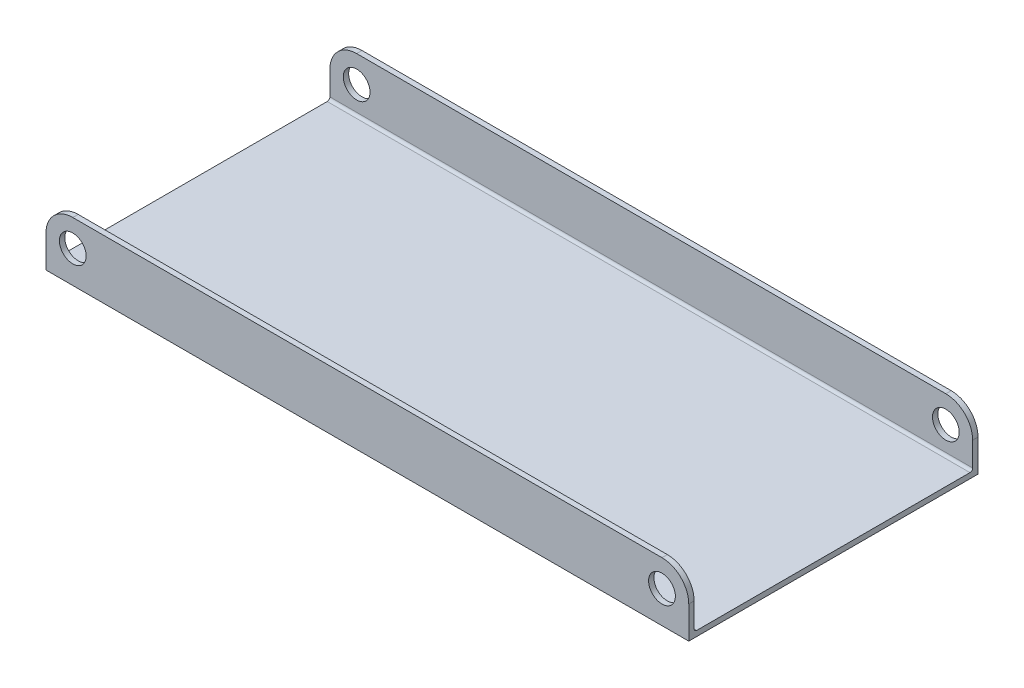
ISO-10303-21;
HEADER;
FILE_DESCRIPTION(('STEP AP214'),'2;1');
FILE_NAME('part.step','',(''),(''),'','','');
FILE_SCHEMA(('AUTOMOTIVE_DESIGN { 1 0 10303 214 1 1 1 1 }'));
ENDSEC;
DATA;
#1=APPLICATION_CONTEXT('core data for automotive mechanical design processes');
#2=APPLICATION_PROTOCOL_DEFINITION('international standard','automotive_design',2000,#1);
#3=PRODUCT_CONTEXT('',#1,'mechanical');
#4=PRODUCT('Part','Part','',(#3));
#5=PRODUCT_RELATED_PRODUCT_CATEGORY('part','',(#4));
#6=PRODUCT_DEFINITION_FORMATION('','',#4);
#7=PRODUCT_DEFINITION_CONTEXT('part definition',#1,'design');
#8=PRODUCT_DEFINITION('design','',#6,#7);
#9=PRODUCT_DEFINITION_SHAPE('','',#8);
#10=(LENGTH_UNIT() NAMED_UNIT(*) SI_UNIT(.MILLI.,.METRE.));
#11=(NAMED_UNIT(*) PLANE_ANGLE_UNIT() SI_UNIT($,.RADIAN.));
#12=(NAMED_UNIT(*) SI_UNIT($,.STERADIAN.) SOLID_ANGLE_UNIT());
#13=UNCERTAINTY_MEASURE_WITH_UNIT(LENGTH_MEASURE(1.E-05),#10,'distance_accuracy_value','');
#14=(GEOMETRIC_REPRESENTATION_CONTEXT(3) GLOBAL_UNCERTAINTY_ASSIGNED_CONTEXT((#13)) GLOBAL_UNIT_ASSIGNED_CONTEXT((#10,
#11,#12)) REPRESENTATION_CONTEXT('',''));
#15=CARTESIAN_POINT('',(0.,0.,0.));
#16=DIRECTION('',(0.,0.,1.));
#17=DIRECTION('',(1.,0.,0.));
#18=AXIS2_PLACEMENT_3D('',#15,#16,#17);
#19=CARTESIAN_POINT('',(0.,1.905,-1.905));
#20=DIRECTION('',(-1.,0.,0.));
#21=DIRECTION('',(0.,0.,1.));
#22=AXIS2_PLACEMENT_3D('',#19,#20,#21);
#23=CYLINDRICAL_SURFACE('',#22,0.635);
#24=DIRECTION('',(1.,0.,0.));
#25=VECTOR('',#24,1.);
#26=CARTESIAN_POINT('',(0.,1.27,-1.905));
#27=LINE('',#26,#25);
#28=CARTESIAN_POINT('',(0.,1.27,-1.905));
#29=VERTEX_POINT('',#28);
#30=CARTESIAN_POINT('',(152.4,1.27,-1.905));
#31=VERTEX_POINT('',#30);
#32=EDGE_CURVE('E193',#29,#31,#27,.T.);
#33=ORIENTED_EDGE('',*,*,#32,.F.);
#34=CARTESIAN_POINT('',(0.,1.905,-1.905));
#35=DIRECTION('',(-1.,0.,0.));
#36=DIRECTION('',(0.,0.,1.));
#37=AXIS2_PLACEMENT_3D('',#34,#35,#36);
#38=CIRCLE('',#37,0.635);
#39=CARTESIAN_POINT('',(0.,1.905,-1.27));
#40=VERTEX_POINT('',#39);
#41=EDGE_CURVE('E44',#29,#40,#38,.T.);
#42=ORIENTED_EDGE('',*,*,#41,.T.);
#43=DIRECTION('',(1.,0.,0.));
#44=VECTOR('',#43,1.);
#45=CARTESIAN_POINT('',(0.,1.905,-1.27));
#46=LINE('',#45,#44);
#47=CARTESIAN_POINT('',(152.4,1.905,-1.27));
#48=VERTEX_POINT('',#47);
#49=EDGE_CURVE('E196',#48,#40,#46,.F.);
#50=ORIENTED_EDGE('',*,*,#49,.F.);
#51=CARTESIAN_POINT('',(152.4,1.905,-1.905));
#52=DIRECTION('',(-1.,0.,0.));
#53=DIRECTION('',(0.,0.,1.));
#54=AXIS2_PLACEMENT_3D('',#51,#52,#53);
#55=CIRCLE('',#54,0.635);
#56=EDGE_CURVE('E11',#48,#31,#55,.F.);
#57=ORIENTED_EDGE('',*,*,#56,.T.);
#58=EDGE_LOOP('',(#33,#42,#50,#57));
#59=FACE_BOUND('',#58,.T.);
#60=ADVANCED_FACE('F37',(#59),#23,.F.);
#61=CARTESIAN_POINT('',(0.,1.905,-66.675));
#62=DIRECTION('',(1.,0.,0.));
#63=DIRECTION('',(0.,0.,-1.));
#64=AXIS2_PLACEMENT_3D('',#61,#62,#63);
#65=CYLINDRICAL_SURFACE('',#64,0.635);
#66=DIRECTION('',(-1.,0.,0.));
#67=VECTOR('',#66,1.);
#68=CARTESIAN_POINT('',(0.,1.27,-66.675));
#69=LINE('',#68,#67);
#70=CARTESIAN_POINT('',(152.4,1.27,-66.675));
#71=VERTEX_POINT('',#70);
#72=CARTESIAN_POINT('',(0.,1.27,-66.675));
#73=VERTEX_POINT('',#72);
#74=EDGE_CURVE('E172',#71,#73,#69,.T.);
#75=ORIENTED_EDGE('',*,*,#74,.F.);
#76=CARTESIAN_POINT('',(152.4,1.905,-66.675));
#77=DIRECTION('',(-1.,0.,0.));
#78=DIRECTION('',(0.,0.,1.));
#79=AXIS2_PLACEMENT_3D('',#76,#77,#78);
#80=CIRCLE('',#79,0.635);
#81=CARTESIAN_POINT('',(152.4,1.905,-67.31));
#82=VERTEX_POINT('',#81);
#83=EDGE_CURVE('E188',#71,#82,#80,.F.);
#84=ORIENTED_EDGE('',*,*,#83,.T.);
#85=DIRECTION('',(-1.,0.,0.));
#86=VECTOR('',#85,1.);
#87=CARTESIAN_POINT('',(0.,1.905,-67.31));
#88=LINE('',#87,#86);
#89=CARTESIAN_POINT('',(0.,1.905,-67.31));
#90=VERTEX_POINT('',#89);
#91=EDGE_CURVE('E185',#90,#82,#88,.F.);
#92=ORIENTED_EDGE('',*,*,#91,.F.);
#93=CARTESIAN_POINT('',(0.,1.905,-66.675));
#94=DIRECTION('',(-1.,0.,0.));
#95=DIRECTION('',(0.,0.,1.));
#96=AXIS2_PLACEMENT_3D('',#93,#94,#95);
#97=CIRCLE('',#96,0.635);
#98=EDGE_CURVE('E190',#90,#73,#97,.T.);
#99=ORIENTED_EDGE('',*,*,#98,.T.);
#100=EDGE_LOOP('',(#75,#84,#92,#99));
#101=FACE_BOUND('',#100,.T.);
#102=ADVANCED_FACE('F297',(#101),#65,.F.);
#103=CARTESIAN_POINT('',(0.,1.27,0.));
#104=DIRECTION('',(0.,0.,-1.));
#105=DIRECTION('',(-1.,0.,0.));
#106=AXIS2_PLACEMENT_3D('',#103,#104,#105);
#107=PLANE('',#106);
#108=CARTESIAN_POINT('',(146.05,7.62,0.));
#109=DIRECTION('',(0.,0.,1.));
#110=DIRECTION('',(1.,0.,0.));
#111=AXIS2_PLACEMENT_3D('',#108,#109,#110);
#112=CIRCLE('',#111,3.175);
#113=CARTESIAN_POINT('',(149.225,7.62,0.));
#114=VERTEX_POINT('',#113);
#115=EDGE_CURVE('E475',#114,#114,#112,.T.);
#116=ORIENTED_EDGE('',*,*,#115,.F.);
#117=EDGE_LOOP('',(#116));
#118=FACE_BOUND('',#117,.T.);
#119=CARTESIAN_POINT('',(6.35,7.62,0.));
#120=DIRECTION('',(0.,0.,1.));
#121=DIRECTION('',(1.,0.,0.));
#122=AXIS2_PLACEMENT_3D('',#119,#120,#121);
#123=CIRCLE('',#122,3.175);
#124=CARTESIAN_POINT('',(9.525,7.62,0.));
#125=VERTEX_POINT('',#124);
#126=EDGE_CURVE('E481',#125,#125,#123,.T.);
#127=ORIENTED_EDGE('',*,*,#126,.F.);
#128=EDGE_LOOP('',(#127));
#129=FACE_BOUND('',#128,.T.);
#130=CARTESIAN_POINT('',(146.05,7.62,0.));
#131=DIRECTION('',(0.,0.,1.));
#132=DIRECTION('',(1.,0.,0.));
#133=AXIS2_PLACEMENT_3D('',#130,#131,#132);
#134=CIRCLE('',#133,6.35);
#135=CARTESIAN_POINT('',(152.4,7.61999999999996,0.));
#136=VERTEX_POINT('',#135);
#137=CARTESIAN_POINT('',(146.05,13.97,0.));
#138=VERTEX_POINT('',#137);
#139=EDGE_CURVE('E156',#136,#138,#134,.T.);
#140=ORIENTED_EDGE('',*,*,#139,.T.);
#141=DIRECTION('',(1.,0.,0.));
#142=VECTOR('',#141,1.);
#143=CARTESIAN_POINT('',(0.,13.97,0.));
#144=LINE('',#143,#142);
#145=CARTESIAN_POINT('',(6.35000000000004,13.97,0.));
#146=VERTEX_POINT('',#145);
#147=EDGE_CURVE('E216',#146,#138,#144,.T.);
#148=ORIENTED_EDGE('',*,*,#147,.F.);
#149=CARTESIAN_POINT('',(6.35,7.62,0.));
#150=DIRECTION('',(0.,0.,1.));
#151=DIRECTION('',(1.,0.,0.));
#152=AXIS2_PLACEMENT_3D('',#149,#150,#151);
#153=CIRCLE('',#152,6.35);
#154=CARTESIAN_POINT('',(0.,7.61999999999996,0.));
#155=VERTEX_POINT('',#154);
#156=EDGE_CURVE('E269',#155,#146,#153,.F.);
#157=ORIENTED_EDGE('',*,*,#156,.F.);
#158=DIRECTION('',(0.,-1.,0.));
#159=VECTOR('',#158,1.);
#160=CARTESIAN_POINT('',(0.,1.27,0.));
#161=LINE('',#160,#159);
#162=CARTESIAN_POINT('',(0.,0.,0.));
#163=VERTEX_POINT('',#162);
#164=EDGE_CURVE('E165',#155,#163,#161,.T.);
#165=ORIENTED_EDGE('',*,*,#164,.T.);
#166=DIRECTION('',(1.,0.,0.));
#167=VECTOR('',#166,1.);
#168=CARTESIAN_POINT('',(0.,0.,0.));
#169=LINE('',#168,#167);
#170=CARTESIAN_POINT('',(152.4,0.,0.));
#171=VERTEX_POINT('',#170);
#172=EDGE_CURVE('E214',#163,#171,#169,.T.);
#173=ORIENTED_EDGE('',*,*,#172,.T.);
#174=DIRECTION('',(0.,-1.,0.));
#175=VECTOR('',#174,1.);
#176=CARTESIAN_POINT('',(152.4,1.27,0.));
#177=LINE('',#176,#175);
#178=EDGE_CURVE('E162',#136,#171,#177,.T.);
#179=ORIENTED_EDGE('',*,*,#178,.F.);
#180=EDGE_LOOP('',(#140,#148,#157,#165,#173,#179));
#181=FACE_BOUND('',#180,.T.);
#182=ADVANCED_FACE('F268',(#118,#129,#181),#107,.F.);
#183=CARTESIAN_POINT('',(0.,1.27,-68.58));
#184=DIRECTION('',(0.,0.,-1.));
#185=DIRECTION('',(-1.,0.,0.));
#186=AXIS2_PLACEMENT_3D('',#183,#184,#185);
#187=PLANE('',#186);
#188=CARTESIAN_POINT('',(146.05,7.62,-68.58));
#189=DIRECTION('',(0.,0.,1.));
#190=DIRECTION('',(1.,0.,0.));
#191=AXIS2_PLACEMENT_3D('',#188,#189,#190);
#192=CIRCLE('',#191,3.175);
#193=CARTESIAN_POINT('',(149.225,7.62,-68.58));
#194=VERTEX_POINT('',#193);
#195=EDGE_CURVE('E182',#194,#194,#192,.T.);
#196=ORIENTED_EDGE('',*,*,#195,.T.);
#197=EDGE_LOOP('',(#196));
#198=FACE_BOUND('',#197,.T.);
#199=CARTESIAN_POINT('',(6.35,7.62,-68.58));
#200=DIRECTION('',(0.,0.,1.));
#201=DIRECTION('',(1.,0.,0.));
#202=AXIS2_PLACEMENT_3D('',#199,#200,#201);
#203=CIRCLE('',#202,3.175);
#204=CARTESIAN_POINT('',(9.525,7.62,-68.58));
#205=VERTEX_POINT('',#204);
#206=EDGE_CURVE('E177',#205,#205,#203,.T.);
#207=ORIENTED_EDGE('',*,*,#206,.T.);
#208=EDGE_LOOP('',(#207));
#209=FACE_BOUND('',#208,.T.);
#210=DIRECTION('',(1.,0.,0.));
#211=VECTOR('',#210,1.);
#212=CARTESIAN_POINT('',(0.,13.97,-68.58));
#213=LINE('',#212,#211);
#214=CARTESIAN_POINT('',(6.35000000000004,13.97,-68.58));
#215=VERTEX_POINT('',#214);
#216=CARTESIAN_POINT('',(146.05,13.97,-68.58));
#217=VERTEX_POINT('',#216);
#218=EDGE_CURVE('E155',#215,#217,#213,.T.);
#219=ORIENTED_EDGE('',*,*,#218,.T.);
#220=CARTESIAN_POINT('',(146.05,7.62,-68.58));
#221=DIRECTION('',(0.,0.,1.));
#222=DIRECTION('',(1.,0.,0.));
#223=AXIS2_PLACEMENT_3D('',#220,#221,#222);
#224=CIRCLE('',#223,6.35);
#225=CARTESIAN_POINT('',(152.4,7.61999999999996,-68.58));
#226=VERTEX_POINT('',#225);
#227=EDGE_CURVE('E137',#226,#217,#224,.T.);
#228=ORIENTED_EDGE('',*,*,#227,.F.);
#229=DIRECTION('',(0.,-1.,0.));
#230=VECTOR('',#229,1.);
#231=CARTESIAN_POINT('',(152.4,1.27,-68.58));
#232=LINE('',#231,#230);
#233=CARTESIAN_POINT('',(152.4,0.,-68.58));
#234=VERTEX_POINT('',#233);
#235=EDGE_CURVE('E151',#226,#234,#232,.T.);
#236=ORIENTED_EDGE('',*,*,#235,.T.);
#237=DIRECTION('',(1.,0.,0.));
#238=VECTOR('',#237,1.);
#239=CARTESIAN_POINT('',(0.,0.,-68.58));
#240=LINE('',#239,#238);
#241=CARTESIAN_POINT('',(0.,0.,-68.58));
#242=VERTEX_POINT('',#241);
#243=EDGE_CURVE('E222',#242,#234,#240,.T.);
#244=ORIENTED_EDGE('',*,*,#243,.F.);
#245=DIRECTION('',(0.,-1.,0.));
#246=VECTOR('',#245,1.);
#247=CARTESIAN_POINT('',(0.,1.27,-68.58));
#248=LINE('',#247,#246);
#249=CARTESIAN_POINT('',(0.,7.61999999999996,-68.58));
#250=VERTEX_POINT('',#249);
#251=EDGE_CURVE('E163',#250,#242,#248,.T.);
#252=ORIENTED_EDGE('',*,*,#251,.F.);
#253=CARTESIAN_POINT('',(6.35,7.62,-68.58));
#254=DIRECTION('',(0.,0.,1.));
#255=DIRECTION('',(1.,0.,0.));
#256=AXIS2_PLACEMENT_3D('',#253,#254,#255);
#257=CIRCLE('',#256,6.35);
#258=EDGE_CURVE('E231',#250,#215,#257,.F.);
#259=ORIENTED_EDGE('',*,*,#258,.T.);
#260=EDGE_LOOP('',(#219,#228,#236,#244,#252,#259));
#261=FACE_BOUND('',#260,.T.);
#262=ADVANCED_FACE('F149',(#198,#209,#261),#187,.T.);
#263=CARTESIAN_POINT('',(0.,13.97,-1.27));
#264=DIRECTION('',(0.,0.,-1.));
#265=DIRECTION('',(-1.,0.,0.));
#266=AXIS2_PLACEMENT_3D('',#263,#264,#265);
#267=PLANE('',#266);
#268=CARTESIAN_POINT('',(146.05,7.62,-1.26999999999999));
#269=DIRECTION('',(0.,0.,-1.));
#270=DIRECTION('',(-1.,0.,0.));
#271=AXIS2_PLACEMENT_3D('',#268,#269,#270);
#272=CIRCLE('',#271,3.175);
#273=CARTESIAN_POINT('',(142.875,7.62,-1.26999999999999));
#274=VERTEX_POINT('',#273);
#275=EDGE_CURVE('E181',#274,#274,#272,.T.);
#276=ORIENTED_EDGE('',*,*,#275,.F.);
#277=EDGE_LOOP('',(#276));
#278=FACE_BOUND('',#277,.T.);
#279=CARTESIAN_POINT('',(6.35,7.62,-1.26999999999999));
#280=DIRECTION('',(0.,0.,-1.));
#281=DIRECTION('',(-1.,0.,0.));
#282=AXIS2_PLACEMENT_3D('',#279,#280,#281);
#283=CIRCLE('',#282,3.175);
#284=CARTESIAN_POINT('',(3.175,7.62,-1.26999999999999));
#285=VERTEX_POINT('',#284);
#286=EDGE_CURVE('E176',#285,#285,#283,.T.);
#287=ORIENTED_EDGE('',*,*,#286,.F.);
#288=EDGE_LOOP('',(#287));
#289=FACE_BOUND('',#288,.T.);
#290=DIRECTION('',(0.,-1.,0.));
#291=VECTOR('',#290,1.);
#292=CARTESIAN_POINT('',(152.4,13.97,-1.27));
#293=LINE('',#292,#291);
#294=CARTESIAN_POINT('',(152.4,7.61999999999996,-1.26999999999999));
#295=VERTEX_POINT('',#294);
#296=EDGE_CURVE('E205',#295,#48,#293,.T.);
#297=ORIENTED_EDGE('',*,*,#296,.T.);
#298=ORIENTED_EDGE('',*,*,#49,.T.);
#299=DIRECTION('',(0.,-1.,0.));
#300=VECTOR('',#299,1.);
#301=CARTESIAN_POINT('',(0.,13.97,-1.27));
#302=LINE('',#301,#300);
#303=CARTESIAN_POINT('',(0.,7.61999999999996,-1.26999999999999));
#304=VERTEX_POINT('',#303);
#305=EDGE_CURVE('E203',#304,#40,#302,.T.);
#306=ORIENTED_EDGE('',*,*,#305,.F.);
#307=CARTESIAN_POINT('',(6.35,7.62,-1.26999999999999));
#308=DIRECTION('',(0.,0.,-1.));
#309=DIRECTION('',(-1.,0.,0.));
#310=AXIS2_PLACEMENT_3D('',#307,#308,#309);
#311=CIRCLE('',#310,6.35);
#312=CARTESIAN_POINT('',(6.35000000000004,13.97,-1.26999999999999));
#313=VERTEX_POINT('',#312);
#314=EDGE_CURVE('E249',#313,#304,#311,.F.);
#315=ORIENTED_EDGE('',*,*,#314,.F.);
#316=DIRECTION('',(1.,0.,0.));
#317=VECTOR('',#316,1.);
#318=CARTESIAN_POINT('',(0.,13.97,-1.27));
#319=LINE('',#318,#317);
#320=CARTESIAN_POINT('',(146.05,13.97,-1.27));
#321=VERTEX_POINT('',#320);
#322=EDGE_CURVE('E257',#313,#321,#319,.T.);
#323=ORIENTED_EDGE('',*,*,#322,.T.);
#324=CARTESIAN_POINT('',(146.05,7.62,-1.26999999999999));
#325=DIRECTION('',(0.,0.,-1.));
#326=DIRECTION('',(-1.,0.,0.));
#327=AXIS2_PLACEMENT_3D('',#324,#325,#326);
#328=CIRCLE('',#327,6.35);
#329=EDGE_CURVE('E280',#321,#295,#328,.T.);
#330=ORIENTED_EDGE('',*,*,#329,.T.);
#331=EDGE_LOOP('',(#297,#298,#306,#315,#323,#330));
#332=FACE_BOUND('',#331,.T.);
#333=ADVANCED_FACE('F201',(#278,#289,#332),#267,.T.);
#334=CARTESIAN_POINT('',(0.,13.97,-67.31));
#335=DIRECTION('',(0.,0.,1.));
#336=DIRECTION('',(1.,0.,0.));
#337=AXIS2_PLACEMENT_3D('',#334,#335,#336);
#338=PLANE('',#337);
#339=CARTESIAN_POINT('',(146.05,7.62,-67.31));
#340=DIRECTION('',(0.,0.,1.));
#341=DIRECTION('',(1.,0.,0.));
#342=AXIS2_PLACEMENT_3D('',#339,#340,#341);
#343=CIRCLE('',#342,3.175);
#344=CARTESIAN_POINT('',(149.225,7.62,-67.31));
#345=VERTEX_POINT('',#344);
#346=EDGE_CURVE('E178',#345,#345,#343,.T.);
#347=ORIENTED_EDGE('',*,*,#346,.F.);
#348=EDGE_LOOP('',(#347));
#349=FACE_BOUND('',#348,.T.);
#350=CARTESIAN_POINT('',(6.35,7.62,-67.31));
#351=DIRECTION('',(0.,0.,1.));
#352=DIRECTION('',(1.,0.,0.));
#353=AXIS2_PLACEMENT_3D('',#350,#351,#352);
#354=CIRCLE('',#353,3.175);
#355=CARTESIAN_POINT('',(9.525,7.62,-67.31));
#356=VERTEX_POINT('',#355);
#357=EDGE_CURVE('E173',#356,#356,#354,.T.);
#358=ORIENTED_EDGE('',*,*,#357,.F.);
#359=EDGE_LOOP('',(#358));
#360=FACE_BOUND('',#359,.T.);
#361=DIRECTION('',(0.,-1.,0.));
#362=VECTOR('',#361,1.);
#363=CARTESIAN_POINT('',(0.,13.97,-67.31));
#364=LINE('',#363,#362);
#365=CARTESIAN_POINT('',(0.,7.61999999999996,-67.31));
#366=VERTEX_POINT('',#365);
#367=EDGE_CURVE('E236',#366,#90,#364,.T.);
#368=ORIENTED_EDGE('',*,*,#367,.T.);
#369=ORIENTED_EDGE('',*,*,#91,.T.);
#370=DIRECTION('',(0.,-1.,0.));
#371=VECTOR('',#370,1.);
#372=CARTESIAN_POINT('',(152.4,13.97,-67.31));
#373=LINE('',#372,#371);
#374=CARTESIAN_POINT('',(152.4,7.61999999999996,-67.31));
#375=VERTEX_POINT('',#374);
#376=EDGE_CURVE('E255',#375,#82,#373,.T.);
#377=ORIENTED_EDGE('',*,*,#376,.F.);
#378=CARTESIAN_POINT('',(146.05,7.62,-67.31));
#379=DIRECTION('',(0.,0.,1.));
#380=DIRECTION('',(1.,0.,0.));
#381=AXIS2_PLACEMENT_3D('',#378,#379,#380);
#382=CIRCLE('',#381,6.35);
#383=CARTESIAN_POINT('',(146.05,13.97,-67.31));
#384=VERTEX_POINT('',#383);
#385=EDGE_CURVE('E140',#375,#384,#382,.T.);
#386=ORIENTED_EDGE('',*,*,#385,.T.);
#387=DIRECTION('',(-1.,0.,0.));
#388=VECTOR('',#387,1.);
#389=CARTESIAN_POINT('',(0.,13.97,-67.31));
#390=LINE('',#389,#388);
#391=CARTESIAN_POINT('',(6.35,13.97,-67.31));
#392=VERTEX_POINT('',#391);
#393=EDGE_CURVE('E251',#384,#392,#390,.T.);
#394=ORIENTED_EDGE('',*,*,#393,.T.);
#395=CARTESIAN_POINT('',(6.35,7.62,-67.31));
#396=DIRECTION('',(0.,0.,1.));
#397=DIRECTION('',(1.,0.,0.));
#398=AXIS2_PLACEMENT_3D('',#395,#396,#397);
#399=CIRCLE('',#398,6.35);
#400=EDGE_CURVE('E247',#366,#392,#399,.F.);
#401=ORIENTED_EDGE('',*,*,#400,.F.);
#402=EDGE_LOOP('',(#368,#369,#377,#386,#394,#401));
#403=FACE_BOUND('',#402,.T.);
#404=ADVANCED_FACE('F309',(#349,#360,#403),#338,.T.);
#405=CARTESIAN_POINT('',(0.,1.27,0.));
#406=DIRECTION('',(-1.,0.,0.));
#407=DIRECTION('',(0.,0.,1.));
#408=AXIS2_PLACEMENT_3D('',#405,#406,#407);
#409=PLANE('',#408);
#410=ORIENTED_EDGE('',*,*,#41,.F.);
#411=DIRECTION('',(0.,0.,-1.));
#412=VECTOR('',#411,1.);
#413=CARTESIAN_POINT('',(0.,1.27,0.));
#414=LINE('',#413,#412);
#415=EDGE_CURVE('E220',#29,#73,#414,.T.);
#416=ORIENTED_EDGE('',*,*,#415,.T.);
#417=ORIENTED_EDGE('',*,*,#98,.F.);
#418=ORIENTED_EDGE('',*,*,#367,.F.);
#419=DIRECTION('',(0.,0.,1.));
#420=VECTOR('',#419,1.);
#421=CARTESIAN_POINT('',(0.,7.61999999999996,-68.58));
#422=LINE('',#421,#420);
#423=EDGE_CURVE('E234',#250,#366,#422,.T.);
#424=ORIENTED_EDGE('',*,*,#423,.F.);
#425=ORIENTED_EDGE('',*,*,#251,.T.);
#426=DIRECTION('',(0.,0.,-1.));
#427=VECTOR('',#426,1.);
#428=CARTESIAN_POINT('',(0.,0.,0.));
#429=LINE('',#428,#427);
#430=EDGE_CURVE('E211',#163,#242,#429,.T.);
#431=ORIENTED_EDGE('',*,*,#430,.F.);
#432=ORIENTED_EDGE('',*,*,#164,.F.);
#433=EDGE_CURVE('E210',#304,#155,#422,.T.);
#434=ORIENTED_EDGE('',*,*,#433,.F.);
#435=ORIENTED_EDGE('',*,*,#305,.T.);
#436=EDGE_LOOP('',(#410,#416,#417,#418,#424,#425,#431,#432,#434,#435));
#437=FACE_BOUND('',#436,.T.);
#438=ADVANCED_FACE('F208',(#437),#409,.T.);
#439=CARTESIAN_POINT('',(152.4,1.27,0.));
#440=DIRECTION('',(-1.,0.,0.));
#441=DIRECTION('',(0.,0.,1.));
#442=AXIS2_PLACEMENT_3D('',#439,#440,#441);
#443=PLANE('',#442);
#444=ORIENTED_EDGE('',*,*,#235,.F.);
#445=DIRECTION('',(0.,0.,1.));
#446=VECTOR('',#445,1.);
#447=CARTESIAN_POINT('',(152.4,7.61999999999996,-68.58));
#448=LINE('',#447,#446);
#449=EDGE_CURVE('E134',#226,#375,#448,.T.);
#450=ORIENTED_EDGE('',*,*,#449,.T.);
#451=ORIENTED_EDGE('',*,*,#376,.T.);
#452=ORIENTED_EDGE('',*,*,#83,.F.);
#453=DIRECTION('',(0.,0.,-1.));
#454=VECTOR('',#453,1.);
#455=CARTESIAN_POINT('',(152.4,1.27,0.));
#456=LINE('',#455,#454);
#457=EDGE_CURVE('E167',#31,#71,#456,.T.);
#458=ORIENTED_EDGE('',*,*,#457,.F.);
#459=ORIENTED_EDGE('',*,*,#56,.F.);
#460=ORIENTED_EDGE('',*,*,#296,.F.);
#461=EDGE_CURVE('E145',#295,#136,#448,.T.);
#462=ORIENTED_EDGE('',*,*,#461,.T.);
#463=ORIENTED_EDGE('',*,*,#178,.T.);
#464=DIRECTION('',(0.,0.,-1.));
#465=VECTOR('',#464,1.);
#466=CARTESIAN_POINT('',(152.4,0.,0.));
#467=LINE('',#466,#465);
#468=EDGE_CURVE('E160',#171,#234,#467,.T.);
#469=ORIENTED_EDGE('',*,*,#468,.T.);
#470=EDGE_LOOP('',(#444,#450,#451,#452,#458,#459,#460,#462,#463,#469));
#471=FACE_BOUND('',#470,.T.);
#472=ADVANCED_FACE('F158',(#471),#443,.F.);
#473=CARTESIAN_POINT('',(0.,1.27,0.));
#474=DIRECTION('',(0.,1.,0.));
#475=DIRECTION('',(0.,0.,1.));
#476=AXIS2_PLACEMENT_3D('',#473,#474,#475);
#477=PLANE('',#476);
#478=ORIENTED_EDGE('',*,*,#415,.F.);
#479=ORIENTED_EDGE('',*,*,#32,.T.);
#480=ORIENTED_EDGE('',*,*,#457,.T.);
#481=ORIENTED_EDGE('',*,*,#74,.T.);
#482=EDGE_LOOP('',(#478,#479,#480,#481));
#483=FACE_BOUND('',#482,.T.);
#484=ADVANCED_FACE('F304',(#483),#477,.T.);
#485=CARTESIAN_POINT('',(0.,0.,0.));
#486=DIRECTION('',(0.,1.,0.));
#487=DIRECTION('',(0.,0.,1.));
#488=AXIS2_PLACEMENT_3D('',#485,#486,#487);
#489=PLANE('',#488);
#490=ORIENTED_EDGE('',*,*,#430,.T.);
#491=ORIENTED_EDGE('',*,*,#243,.T.);
#492=ORIENTED_EDGE('',*,*,#468,.F.);
#493=ORIENTED_EDGE('',*,*,#172,.F.);
#494=EDGE_LOOP('',(#490,#491,#492,#493));
#495=FACE_BOUND('',#494,.T.);
#496=ADVANCED_FACE('F227',(#495),#489,.F.);
#497=CARTESIAN_POINT('',(0.,13.97,0.));
#498=DIRECTION('',(0.,1.,0.));
#499=DIRECTION('',(0.,0.,1.));
#500=AXIS2_PLACEMENT_3D('',#497,#498,#499);
#501=PLANE('',#500);
#502=DIRECTION('',(0.,0.,1.));
#503=VECTOR('',#502,1.);
#504=CARTESIAN_POINT('',(146.05,13.97,-68.58));
#505=LINE('',#504,#503);
#506=EDGE_CURVE('E144',#321,#138,#505,.T.);
#507=ORIENTED_EDGE('',*,*,#506,.F.);
#508=ORIENTED_EDGE('',*,*,#322,.F.);
#509=DIRECTION('',(0.,0.,1.));
#510=VECTOR('',#509,1.);
#511=CARTESIAN_POINT('',(6.35000000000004,13.97,-68.58));
#512=LINE('',#511,#510);
#513=EDGE_CURVE('E240',#313,#146,#512,.T.);
#514=ORIENTED_EDGE('',*,*,#513,.T.);
#515=ORIENTED_EDGE('',*,*,#147,.T.);
#516=EDGE_LOOP('',(#507,#508,#514,#515));
#517=FACE_BOUND('',#516,.T.);
#518=ADVANCED_FACE('F263',(#517),#501,.T.);
#519=CARTESIAN_POINT('',(0.,13.97,0.));
#520=DIRECTION('',(0.,1.,0.));
#521=DIRECTION('',(0.,0.,1.));
#522=AXIS2_PLACEMENT_3D('',#519,#520,#521);
#523=PLANE('',#522);
#524=EDGE_CURVE('E277',#217,#384,#505,.T.);
#525=ORIENTED_EDGE('',*,*,#524,.F.);
#526=ORIENTED_EDGE('',*,*,#218,.F.);
#527=EDGE_CURVE('E243',#215,#392,#512,.T.);
#528=ORIENTED_EDGE('',*,*,#527,.T.);
#529=ORIENTED_EDGE('',*,*,#393,.F.);
#530=EDGE_LOOP('',(#525,#526,#528,#529));
#531=FACE_BOUND('',#530,.T.);
#532=ADVANCED_FACE('F314',(#531),#523,.T.);
#533=CARTESIAN_POINT('',(6.35,7.62,-68.58));
#534=DIRECTION('',(0.,0.,1.));
#535=DIRECTION('',(1.,0.,0.));
#536=AXIS2_PLACEMENT_3D('',#533,#534,#535);
#537=CYLINDRICAL_SURFACE('',#536,6.35);
#538=ORIENTED_EDGE('',*,*,#400,.T.);
#539=ORIENTED_EDGE('',*,*,#527,.F.);
#540=ORIENTED_EDGE('',*,*,#258,.F.);
#541=ORIENTED_EDGE('',*,*,#423,.T.);
#542=EDGE_LOOP('',(#538,#539,#540,#541));
#543=FACE_BOUND('',#542,.T.);
#544=ADVANCED_FACE('F312',(#543),#537,.T.);
#545=ORIENTED_EDGE('',*,*,#314,.T.);
#546=ORIENTED_EDGE('',*,*,#433,.T.);
#547=ORIENTED_EDGE('',*,*,#156,.T.);
#548=ORIENTED_EDGE('',*,*,#513,.F.);
#549=EDGE_LOOP('',(#545,#546,#547,#548));
#550=FACE_BOUND('',#549,.T.);
#551=ADVANCED_FACE('F283',(#550),#537,.T.);
#552=CARTESIAN_POINT('',(146.05,7.62,-68.58));
#553=DIRECTION('',(0.,0.,1.));
#554=DIRECTION('',(1.,0.,0.));
#555=AXIS2_PLACEMENT_3D('',#552,#553,#554);
#556=CYLINDRICAL_SURFACE('',#555,6.35);
#557=ORIENTED_EDGE('',*,*,#449,.F.);
#558=ORIENTED_EDGE('',*,*,#227,.T.);
#559=ORIENTED_EDGE('',*,*,#524,.T.);
#560=ORIENTED_EDGE('',*,*,#385,.F.);
#561=EDGE_LOOP('',(#557,#558,#559,#560));
#562=FACE_BOUND('',#561,.T.);
#563=ADVANCED_FACE('F136',(#562),#556,.T.);
#564=ORIENTED_EDGE('',*,*,#506,.T.);
#565=ORIENTED_EDGE('',*,*,#139,.F.);
#566=ORIENTED_EDGE('',*,*,#461,.F.);
#567=ORIENTED_EDGE('',*,*,#329,.F.);
#568=EDGE_LOOP('',(#564,#565,#566,#567));
#569=FACE_BOUND('',#568,.T.);
#570=ADVANCED_FACE('F284',(#569),#556,.T.);
#571=CARTESIAN_POINT('',(6.35,7.62,-68.58));
#572=DIRECTION('',(0.,0.,1.));
#573=DIRECTION('',(1.,0.,0.));
#574=AXIS2_PLACEMENT_3D('',#571,#572,#573);
#575=CYLINDRICAL_SURFACE('',#574,3.175);
#576=ORIENTED_EDGE('',*,*,#357,.T.);
#577=EDGE_LOOP('',(#576));
#578=FACE_BOUND('',#577,.T.);
#579=ORIENTED_EDGE('',*,*,#206,.F.);
#580=EDGE_LOOP('',(#579));
#581=FACE_BOUND('',#580,.T.);
#582=ADVANCED_FACE('F286',(#578,#581),#575,.F.);
#583=ORIENTED_EDGE('',*,*,#286,.T.);
#584=EDGE_LOOP('',(#583));
#585=FACE_BOUND('',#584,.T.);
#586=ORIENTED_EDGE('',*,*,#126,.T.);
#587=EDGE_LOOP('',(#586));
#588=FACE_BOUND('',#587,.T.);
#589=ADVANCED_FACE('F292',(#585,#588),#575,.F.);
#590=CARTESIAN_POINT('',(146.05,7.62,-68.58));
#591=DIRECTION('',(0.,0.,1.));
#592=DIRECTION('',(1.,0.,0.));
#593=AXIS2_PLACEMENT_3D('',#590,#591,#592);
#594=CYLINDRICAL_SURFACE('',#593,3.175);
#595=ORIENTED_EDGE('',*,*,#346,.T.);
#596=EDGE_LOOP('',(#595));
#597=FACE_BOUND('',#596,.T.);
#598=ORIENTED_EDGE('',*,*,#195,.F.);
#599=EDGE_LOOP('',(#598));
#600=FACE_BOUND('',#599,.T.);
#601=ADVANCED_FACE('F420',(#597,#600),#594,.F.);
#602=ORIENTED_EDGE('',*,*,#275,.T.);
#603=EDGE_LOOP('',(#602));
#604=FACE_BOUND('',#603,.T.);
#605=ORIENTED_EDGE('',*,*,#115,.T.);
#606=EDGE_LOOP('',(#605));
#607=FACE_BOUND('',#606,.T.);
#608=ADVANCED_FACE('F429',(#604,#607),#594,.F.);
#609=CLOSED_SHELL('',(#60,#102,#182,#262,#333,#404,#438,#472,#484,#496,#518,#532,#544,#551,#563,
#570,#582,#589,#601,#608));
#610=MANIFOLD_SOLID_BREP('B2',#609);
#611=ADVANCED_BREP_SHAPE_REPRESENTATION('',(#18,#610),#14);
#612=SHAPE_DEFINITION_REPRESENTATION(#9,#611);
ENDSEC;
END-ISO-10303-21;
